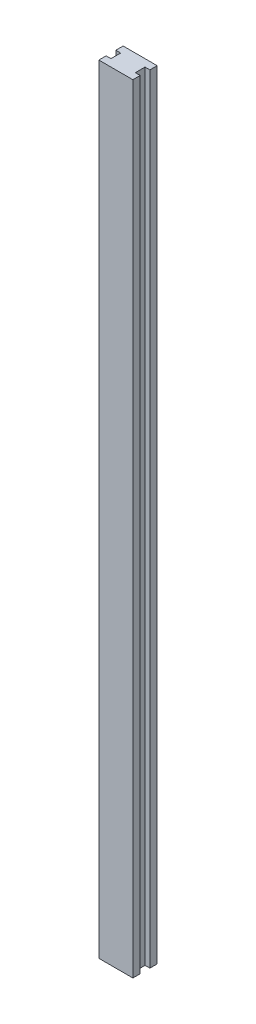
from build123d import *

# Parameters (mm, degrees)
EXTRUDE_2_DEPTH = 160


with BuildPart() as part:
    # Sketch 2 → Extrude 2 (new body)
    with BuildSketch(Plane(origin=(0, 0, 0), x_dir=(1, 0, 0), z_dir=(0, 1, 0))):
        Polygon((-3.5, 1), (-3.5, 2.5), (3.5, 2.5), (3.5, 1), (2.5, 1), (2.5, -1), (3.5, -1), (3.5, -2.5), (-3.5, -2.5), (-3.5, -1), (-2.5, -1), (-2.5, 1), align=None)
    extrude(amount=EXTRUDE_2_DEPTH)


solid = part.part
